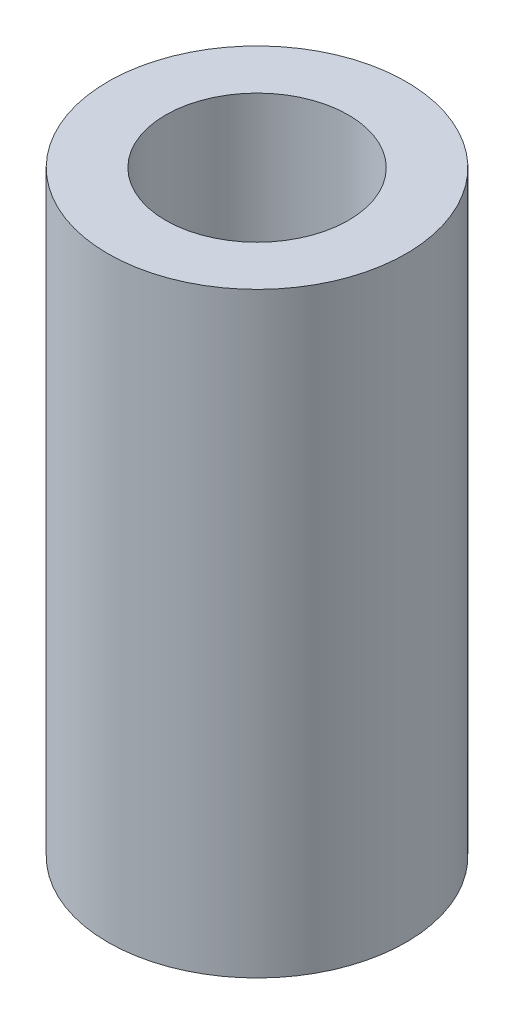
from build123d import *

# Parameters (mm, degrees)
SKETCH1_R           = 3.875
SKETCH1_R_2         = 2.375
BOSS_EXTRUDE1_DEPTH = 15.5


with BuildPart() as part:
    # Sketch1 → Boss-Extrude1 (new body)
    with BuildSketch(Plane(origin=(0, 0, 0), x_dir=(1, 0, 0), z_dir=(0, 1, 0))):
        with Locations(Location((0, 0, 0), (0, 0, 270))):
            Circle(SKETCH1_R)
        with Locations(Location((0, 0, 0), (0, 0, 270))):
            Circle(SKETCH1_R_2, mode=Mode.SUBTRACT)
    extrude(amount=BOSS_EXTRUDE1_DEPTH)


solid = part.part
